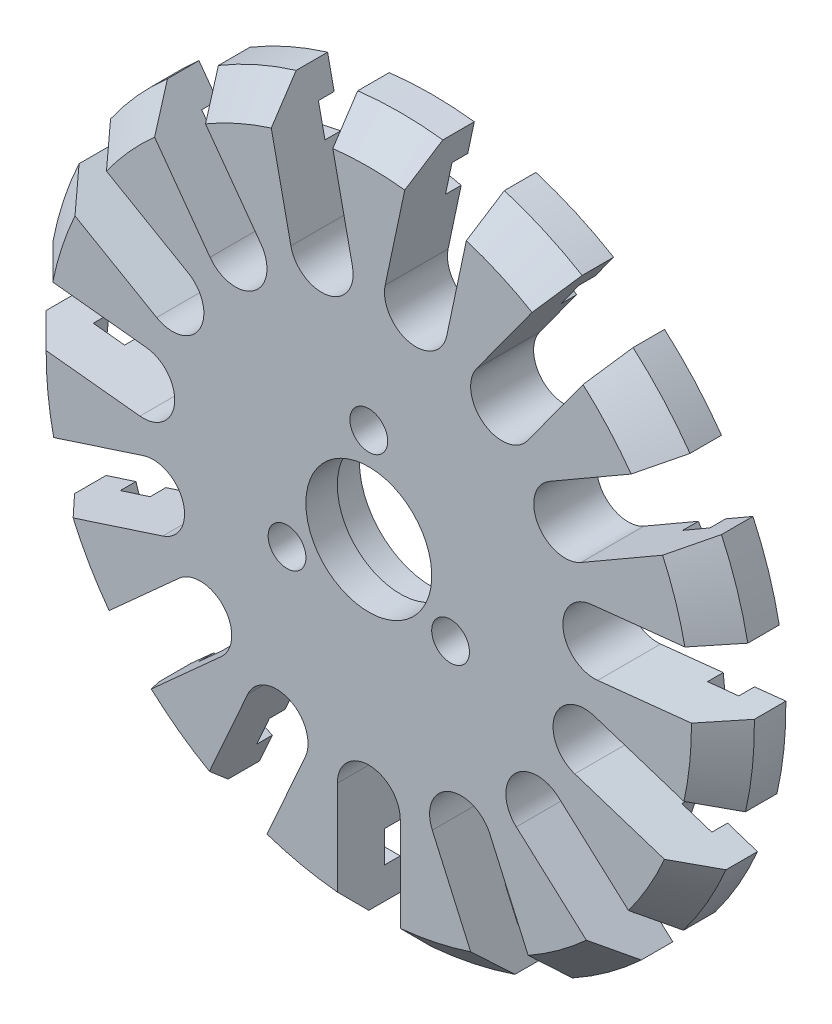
from build123d import *

# Parameters (mm, degrees)
ESBO_O1_R                = 22.5
RESSALTO_EXTRUS_O1_DEPTH = 4
CHANFRO1_SIZE            = 2
ESBO_O4_R                = 4.6
CORTE_EXTRUS_O2_DEPTH    = 2
ESBO_O5_R                = 4
CORTE_EXTRUS_O3_DEPTH    = 2
CORTE_EXTRUS_O4_DEPTH    = 4
PADR_OCIRCULAR1_COUNT    = 15
FURO_COM_FOLGA_DE_M21_D  = 2.4
PADR_OCIRCULAR2_COUNT    = 3
ESBO_O12_W               = 7
ESBO_O12_H               = 2
CORTE_EXTRUS_O5_DEPTH    = 1
PADR_OCIRCULAR3_COUNT    = 15


with BuildPart() as part:
    # Esbo_o1 → Ressalto-extrus_o1 (new body)
    with BuildSketch(Plane.XY):
        Circle(ESBO_O1_R)
    extrude(amount=RESSALTO_EXTRUS_O1_DEPTH)

    # Chanfro1
    chanfro1_edges = [part.edges().sort_by_distance(p)[0] for p in [
        (-22.5, 0, 4),
    ]]
    chamfer(chanfro1_edges, length=CHANFRO1_SIZE)

    # Esbo_o4 → Corte-extrus_o2 (cut)
    with BuildSketch(Plane(origin=(0, 0, 0), x_dir=(-1, 0, 0), z_dir=(0, 0, -1))):
        Circle(ESBO_O4_R)
    extrude(amount=-CORTE_EXTRUS_O2_DEPTH, mode=Mode.SUBTRACT)

    # Esbo_o5 → Corte-extrus_o3 (cut)
    with BuildSketch(Plane(origin=(0, 0, 2), x_dir=(-1, 0, 0), z_dir=(0, 0, -1))):
        Circle(ESBO_O5_R)
    extrude(amount=-CORTE_EXTRUS_O3_DEPTH, mode=Mode.SUBTRACT)

    # Esbo_o6 → Corte-extrus_o4 (cut)
    with BuildSketch(Plane(origin=(0, 0, 0), x_dir=(-1, 0, 0), z_dir=(0, 0, -1))):
        with BuildLine():
            Line((2, -22.410934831), (2, -14.410934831))
            ThreePointArc((2, -14.410934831), (0, -12.410934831), (-2, -14.410934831))
            Line((-2, -14.410934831), (-2, -22.410934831))
            ThreePointArc((-2, -22.410934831), (0, -22.5), (2, -22.410934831))
        make_face()
    corte_extrus_o4 = extrude(amount=-CORTE_EXTRUS_O4_DEPTH, mode=Mode.SUBTRACT)

    # Padr_oCircular1: Corte-extrus_o4 ×15 about axis
    padr_ocircular1_axis = Axis((0, 0, 0), (0, 0, 1))
    for i in range(1, PADR_OCIRCULAR1_COUNT):
        add(corte_extrus_o4.rotate(padr_ocircular1_axis, i * 360 / PADR_OCIRCULAR1_COUNT), mode=Mode.SUBTRACT)

    # Furo com folga de M21 (through all)
    with Locations(Plane(origin=(0, 6, 4), x_dir=(1, 0, 0), z_dir=(0, 0, 1))):
        with Locations((0, 0)):
            furo_com_folga_de_m21 = Hole(FURO_COM_FOLGA_DE_M21_D / 2)

    # Padr_oCircular2: Furo com folga de M21 ×3 about axis
    padr_ocircular2_axis = Axis((0, 0, 0), (0, 0, 1))
    for i in range(1, PADR_OCIRCULAR2_COUNT):
        add(furo_com_folga_de_m21.rotate(padr_ocircular2_axis, i * 360 / PADR_OCIRCULAR2_COUNT), mode=Mode.SUBTRACT)

    # Esbo_o12 → Corte-extrus_o5 (cut)
    with BuildSketch(Plane(origin=(0, 0, 0), x_dir=(-1, 0, 0), z_dir=(0, 0, -1))):
        with Locations((0, -19.410934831)):
            Rectangle(ESBO_O12_W, ESBO_O12_H)
    corte_extrus_o5 = extrude(amount=-CORTE_EXTRUS_O5_DEPTH, mode=Mode.SUBTRACT)

    # Padr_oCircular3: Corte-extrus_o5 ×15 about axis
    padr_ocircular3_axis = Axis((0, 0, 0), (0, 0, 1))
    for i in range(1, PADR_OCIRCULAR3_COUNT):
        add(corte_extrus_o5.rotate(padr_ocircular3_axis, i * 360 / PADR_OCIRCULAR3_COUNT), mode=Mode.SUBTRACT)


solid = part.part
